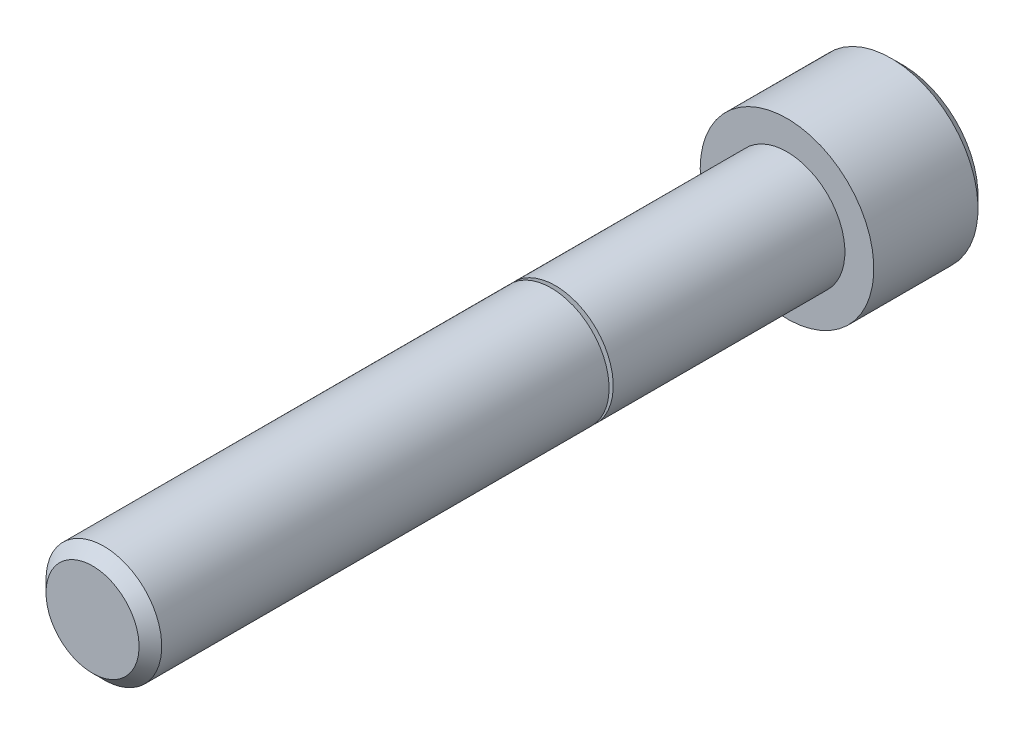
ISO-10303-21;
HEADER;
FILE_DESCRIPTION(('STEP AP214'),'2;1');
FILE_NAME('part.step','',(''),(''),'','','');
FILE_SCHEMA(('AUTOMOTIVE_DESIGN { 1 0 10303 214 1 1 1 1 }'));
ENDSEC;
DATA;
#1=APPLICATION_CONTEXT('core data for automotive mechanical design processes');
#2=APPLICATION_PROTOCOL_DEFINITION('international standard','automotive_design',2000,#1);
#3=PRODUCT_CONTEXT('',#1,'mechanical');
#4=PRODUCT('Part','Part','',(#3));
#5=PRODUCT_RELATED_PRODUCT_CATEGORY('part','',(#4));
#6=PRODUCT_DEFINITION_FORMATION('','',#4);
#7=PRODUCT_DEFINITION_CONTEXT('part definition',#1,'design');
#8=PRODUCT_DEFINITION('design','',#6,#7);
#9=PRODUCT_DEFINITION_SHAPE('','',#8);
#10=(LENGTH_UNIT() NAMED_UNIT(*) SI_UNIT(.MILLI.,.METRE.));
#11=(NAMED_UNIT(*) PLANE_ANGLE_UNIT() SI_UNIT($,.RADIAN.));
#12=(NAMED_UNIT(*) SI_UNIT($,.STERADIAN.) SOLID_ANGLE_UNIT());
#13=UNCERTAINTY_MEASURE_WITH_UNIT(LENGTH_MEASURE(1.E-05),#10,'distance_accuracy_value','');
#14=(GEOMETRIC_REPRESENTATION_CONTEXT(3) GLOBAL_UNCERTAINTY_ASSIGNED_CONTEXT((#13)) GLOBAL_UNIT_ASSIGNED_CONTEXT((#10,
#11,#12)) REPRESENTATION_CONTEXT('',''));
#15=CARTESIAN_POINT('',(0.,0.,0.));
#16=DIRECTION('',(0.,0.,1.));
#17=DIRECTION('',(1.,0.,0.));
#18=AXIS2_PLACEMENT_3D('',#15,#16,#17);
#19=CARTESIAN_POINT('',(0.,0.,-6.34999999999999));
#20=DIRECTION('',(0.,0.,1.));
#21=DIRECTION('',(1.,0.,0.));
#22=AXIS2_PLACEMENT_3D('',#19,#20,#21);
#23=PLANE('',#22);
#24=DIRECTION('',(-0.5,-0.866025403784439,0.));
#25=VECTOR('',#24,1.);
#26=CARTESIAN_POINT('',(2.74963065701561,0.,-6.34999999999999));
#27=LINE('',#26,#25);
#28=CARTESIAN_POINT('',(2.74963065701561,0.,-6.34999999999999));
#29=VERTEX_POINT('',#28);
#30=CARTESIAN_POINT('',(1.37481532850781,-2.38125000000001,-6.34999999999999));
#31=VERTEX_POINT('',#30);
#32=EDGE_CURVE('E145',#29,#31,#27,.T.);
#33=ORIENTED_EDGE('',*,*,#32,.F.);
#34=DIRECTION('',(0.499999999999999,-0.866025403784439,0.));
#35=VECTOR('',#34,1.);
#36=CARTESIAN_POINT('',(1.37481532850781,2.38125,-6.34999999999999));
#37=LINE('',#36,#35);
#38=CARTESIAN_POINT('',(1.37481532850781,2.38125,-6.34999999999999));
#39=VERTEX_POINT('',#38);
#40=EDGE_CURVE('E64',#39,#29,#37,.T.);
#41=ORIENTED_EDGE('',*,*,#40,.F.);
#42=DIRECTION('',(1.,0.,0.));
#43=VECTOR('',#42,1.);
#44=CARTESIAN_POINT('',(-1.37481532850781,2.38125,-6.34999999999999));
#45=LINE('',#44,#43);
#46=CARTESIAN_POINT('',(-1.37481532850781,2.38125,-6.34999999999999));
#47=VERTEX_POINT('',#46);
#48=EDGE_CURVE('E158',#47,#39,#45,.T.);
#49=ORIENTED_EDGE('',*,*,#48,.F.);
#50=DIRECTION('',(0.5,0.866025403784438,0.));
#51=VECTOR('',#50,1.);
#52=CARTESIAN_POINT('',(-2.74963065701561,0.,-6.34999999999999));
#53=LINE('',#52,#51);
#54=CARTESIAN_POINT('',(-2.74963065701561,0.,-6.34999999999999));
#55=VERTEX_POINT('',#54);
#56=EDGE_CURVE('E155',#55,#47,#53,.T.);
#57=ORIENTED_EDGE('',*,*,#56,.F.);
#58=DIRECTION('',(-0.5,0.866025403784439,0.));
#59=VECTOR('',#58,1.);
#60=CARTESIAN_POINT('',(-1.37481532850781,-2.38125000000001,-6.34999999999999));
#61=LINE('',#60,#59);
#62=CARTESIAN_POINT('',(-1.37481532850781,-2.38125000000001,-6.34999999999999));
#63=VERTEX_POINT('',#62);
#64=EDGE_CURVE('E112',#63,#55,#61,.T.);
#65=ORIENTED_EDGE('',*,*,#64,.F.);
#66=DIRECTION('',(-1.,0.,0.));
#67=VECTOR('',#66,1.);
#68=CARTESIAN_POINT('',(1.37481532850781,-2.38125000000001,-6.34999999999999));
#69=LINE('',#68,#67);
#70=EDGE_CURVE('E149',#31,#63,#69,.T.);
#71=ORIENTED_EDGE('',*,*,#70,.F.);
#72=EDGE_LOOP('',(#33,#41,#49,#57,#65,#71));
#73=FACE_BOUND('',#72,.T.);
#74=CARTESIAN_POINT('',(0.,0.,-6.34999999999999));
#75=DIRECTION('',(0.,0.,-1.));
#76=DIRECTION('',(-1.,0.,0.));
#77=AXIS2_PLACEMENT_3D('',#74,#75,#76);
#78=CIRCLE('',#77,4.1275);
#79=CARTESIAN_POINT('',(-4.1275,0.,-6.34999999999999));
#80=VERTEX_POINT('',#79);
#81=EDGE_CURVE('E164',#80,#80,#78,.T.);
#82=ORIENTED_EDGE('',*,*,#81,.T.);
#83=EDGE_LOOP('',(#82));
#84=FACE_BOUND('',#83,.T.);
#85=ADVANCED_FACE('F49',(#73,#84),#23,.F.);
#86=CARTESIAN_POINT('',(-2.55270000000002,0.,38.1));
#87=DIRECTION('',(0.,0.,-1.));
#88=DIRECTION('',(-1.,0.,0.));
#89=AXIS2_PLACEMENT_3D('',#86,#87,#88);
#90=PLANE('',#89);
#91=CARTESIAN_POINT('',(0.,0.,38.1));
#92=DIRECTION('',(0.,0.,-1.));
#93=DIRECTION('',(-1.,0.,0.));
#94=AXIS2_PLACEMENT_3D('',#91,#92,#93);
#95=CIRCLE('',#94,2.55270000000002);
#96=CARTESIAN_POINT('',(-2.55270000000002,0.,38.1));
#97=VERTEX_POINT('',#96);
#98=EDGE_CURVE('E11',#97,#97,#95,.T.);
#99=ORIENTED_EDGE('',*,*,#98,.F.);
#100=EDGE_LOOP('',(#99));
#101=FACE_BOUND('',#100,.T.);
#102=ADVANCED_FACE('F214',(#101),#90,.F.);
#103=CARTESIAN_POINT('',(0.,0.,38.1));
#104=DIRECTION('',(0.,0.,-1.));
#105=DIRECTION('',(-1.,0.,0.));
#106=AXIS2_PLACEMENT_3D('',#103,#104,#105);
#107=CONICAL_SURFACE('',#106,2.55270000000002,0.785398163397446);
#108=CARTESIAN_POINT('',(0.,0.,37.4777));
#109=DIRECTION('',(0.,0.,-1.));
#110=DIRECTION('',(-1.,0.,0.));
#111=AXIS2_PLACEMENT_3D('',#108,#109,#110);
#112=CIRCLE('',#111,3.17500000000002);
#113=CARTESIAN_POINT('',(-3.17500000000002,0.,37.4777));
#114=VERTEX_POINT('',#113);
#115=EDGE_CURVE('E57',#114,#114,#112,.T.);
#116=ORIENTED_EDGE('',*,*,#115,.F.);
#117=EDGE_LOOP('',(#116));
#118=FACE_BOUND('',#117,.T.);
#119=ORIENTED_EDGE('',*,*,#98,.T.);
#120=EDGE_LOOP('',(#119));
#121=FACE_BOUND('',#120,.T.);
#122=ADVANCED_FACE('F211',(#118,#121),#107,.T.);
#123=CARTESIAN_POINT('',(0.,0.,-10.585154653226));
#124=DIRECTION('',(0.,0.,-1.));
#125=DIRECTION('',(-1.,0.,0.));
#126=AXIS2_PLACEMENT_3D('',#123,#124,#125);
#127=CYLINDRICAL_SURFACE('',#126,3.17500000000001);
#128=CARTESIAN_POINT('',(0.,0.,12.9364986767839));
#129=DIRECTION('',(0.,0.,-1.));
#130=DIRECTION('',(-1.,0.,0.));
#131=AXIS2_PLACEMENT_3D('',#128,#129,#130);
#132=CIRCLE('',#131,3.17500000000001);
#133=CARTESIAN_POINT('',(-3.17500000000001,0.,12.9364986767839));
#134=VERTEX_POINT('',#133);
#135=EDGE_CURVE('E201',#134,#134,#132,.T.);
#136=ORIENTED_EDGE('',*,*,#135,.F.);
#137=EDGE_LOOP('',(#136));
#138=FACE_BOUND('',#137,.T.);
#139=ORIENTED_EDGE('',*,*,#115,.T.);
#140=EDGE_LOOP('',(#139));
#141=FACE_BOUND('',#140,.T.);
#142=ADVANCED_FACE('F209',(#138,#141),#127,.T.);
#143=CARTESIAN_POINT('',(0.,0.,12.9364986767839));
#144=DIRECTION('',(0.,0.,1.));
#145=DIRECTION('',(1.,0.,0.));
#146=AXIS2_PLACEMENT_3D('',#143,#144,#145);
#147=CONICAL_SURFACE('',#146,3.17500000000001,1.22173047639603);
#148=CARTESIAN_POINT('',(0.,0.,12.7487938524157));
#149=DIRECTION('',(0.,0.,-1.));
#150=DIRECTION('',(-1.,0.,0.));
#151=AXIS2_PLACEMENT_3D('',#148,#149,#150);
#152=CIRCLE('',#151,2.65928523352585);
#153=CARTESIAN_POINT('',(-2.65928523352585,0.,12.7487938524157));
#154=VERTEX_POINT('',#153);
#155=EDGE_CURVE('E197',#154,#154,#152,.T.);
#156=ORIENTED_EDGE('',*,*,#155,.F.);
#157=EDGE_LOOP('',(#156));
#158=FACE_BOUND('',#157,.T.);
#159=ORIENTED_EDGE('',*,*,#135,.T.);
#160=EDGE_LOOP('',(#159));
#161=FACE_BOUND('',#160,.T.);
#162=ADVANCED_FACE('F226',(#158,#161),#147,.T.);
#163=CARTESIAN_POINT('',(0.,0.,12.73));
#164=DIRECTION('',(0.,0.,-1.));
#165=DIRECTION('',(-1.,0.,0.));
#166=AXIS2_PLACEMENT_3D('',#163,#164,#165);
#167=TOROIDAL_SURFACE('',#166,2.66612563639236,0.0199999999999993);
#168=CARTESIAN_POINT('',(0.,0.,12.71));
#169=DIRECTION('',(0.,0.,-1.));
#170=DIRECTION('',(-1.,0.,0.));
#171=AXIS2_PLACEMENT_3D('',#168,#169,#170);
#172=CIRCLE('',#171,2.66612563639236);
#173=CARTESIAN_POINT('',(-2.66612563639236,0.,12.71));
#174=VERTEX_POINT('',#173);
#175=EDGE_CURVE('E193',#174,#174,#172,.T.);
#176=ORIENTED_EDGE('',*,*,#175,.F.);
#177=EDGE_LOOP('',(#176));
#178=FACE_BOUND('',#177,.T.);
#179=ORIENTED_EDGE('',*,*,#155,.T.);
#180=EDGE_LOOP('',(#179));
#181=FACE_BOUND('',#180,.T.);
#182=ADVANCED_FACE('F230',(#178,#181),#167,.F.);
#183=CARTESIAN_POINT('',(-3.17499999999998,0.,12.71));
#184=DIRECTION('',(0.,0.,-1.));
#185=DIRECTION('',(-1.,0.,0.));
#186=AXIS2_PLACEMENT_3D('',#183,#184,#185);
#187=PLANE('',#186);
#188=CARTESIAN_POINT('',(0.,0.,12.71));
#189=DIRECTION('',(0.,0.,-1.));
#190=DIRECTION('',(-1.,0.,0.));
#191=AXIS2_PLACEMENT_3D('',#188,#189,#190);
#192=CIRCLE('',#191,3.17500000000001);
#193=CARTESIAN_POINT('',(-3.17500000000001,0.,12.71));
#194=VERTEX_POINT('',#193);
#195=EDGE_CURVE('E189',#194,#194,#192,.T.);
#196=ORIENTED_EDGE('',*,*,#195,.F.);
#197=EDGE_LOOP('',(#196));
#198=FACE_BOUND('',#197,.T.);
#199=ORIENTED_EDGE('',*,*,#175,.T.);
#200=EDGE_LOOP('',(#199));
#201=FACE_BOUND('',#200,.T.);
#202=ADVANCED_FACE('F234',(#198,#201),#187,.F.);
#203=CARTESIAN_POINT('',(0.,0.,-10.585154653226));
#204=DIRECTION('',(0.,0.,-1.));
#205=DIRECTION('',(-1.,0.,0.));
#206=AXIS2_PLACEMENT_3D('',#203,#204,#205);
#207=CYLINDRICAL_SURFACE('',#206,3.17500000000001);
#208=CARTESIAN_POINT('',(0.,0.,0.));
#209=DIRECTION('',(0.,0.,-1.));
#210=DIRECTION('',(-1.,0.,0.));
#211=AXIS2_PLACEMENT_3D('',#208,#209,#210);
#212=CIRCLE('',#211,3.175);
#213=CARTESIAN_POINT('',(-3.175,0.,0.));
#214=VERTEX_POINT('',#213);
#215=EDGE_CURVE('E185',#214,#214,#212,.T.);
#216=ORIENTED_EDGE('',*,*,#215,.F.);
#217=EDGE_LOOP('',(#216));
#218=FACE_BOUND('',#217,.T.);
#219=ORIENTED_EDGE('',*,*,#195,.T.);
#220=EDGE_LOOP('',(#219));
#221=FACE_BOUND('',#220,.T.);
#222=ADVANCED_FACE('F238',(#218,#221),#207,.T.);
#223=CARTESIAN_POINT('',(-4.7625,0.,0.));
#224=DIRECTION('',(0.,0.,-1.));
#225=DIRECTION('',(-1.,0.,0.));
#226=AXIS2_PLACEMENT_3D('',#223,#224,#225);
#227=PLANE('',#226);
#228=CARTESIAN_POINT('',(0.,0.,0.));
#229=DIRECTION('',(0.,0.,-1.));
#230=DIRECTION('',(-1.,0.,0.));
#231=AXIS2_PLACEMENT_3D('',#228,#229,#230);
#232=CIRCLE('',#231,4.7625);
#233=CARTESIAN_POINT('',(-4.7625,0.,0.));
#234=VERTEX_POINT('',#233);
#235=EDGE_CURVE('E181',#234,#234,#232,.T.);
#236=ORIENTED_EDGE('',*,*,#235,.F.);
#237=EDGE_LOOP('',(#236));
#238=FACE_BOUND('',#237,.T.);
#239=ORIENTED_EDGE('',*,*,#215,.T.);
#240=EDGE_LOOP('',(#239));
#241=FACE_BOUND('',#240,.T.);
#242=ADVANCED_FACE('F242',(#238,#241),#227,.F.);
#243=CARTESIAN_POINT('',(0.,0.,-10.585154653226));
#244=DIRECTION('',(0.,0.,-1.));
#245=DIRECTION('',(-1.,0.,0.));
#246=AXIS2_PLACEMENT_3D('',#243,#244,#245);
#247=CYLINDRICAL_SURFACE('',#246,4.7625);
#248=CARTESIAN_POINT('',(0.,0.,-5.715));
#249=DIRECTION('',(0.,0.,-1.));
#250=DIRECTION('',(-1.,0.,0.));
#251=AXIS2_PLACEMENT_3D('',#248,#249,#250);
#252=CIRCLE('',#251,4.7625);
#253=CARTESIAN_POINT('',(-4.7625,0.,-5.715));
#254=VERTEX_POINT('',#253);
#255=EDGE_CURVE('E177',#254,#254,#252,.T.);
#256=ORIENTED_EDGE('',*,*,#255,.F.);
#257=EDGE_LOOP('',(#256));
#258=FACE_BOUND('',#257,.T.);
#259=ORIENTED_EDGE('',*,*,#235,.T.);
#260=EDGE_LOOP('',(#259));
#261=FACE_BOUND('',#260,.T.);
#262=ADVANCED_FACE('F246',(#258,#261),#247,.T.);
#263=CARTESIAN_POINT('',(0.,0.,-5.715));
#264=DIRECTION('',(0.,0.,1.));
#265=DIRECTION('',(1.,0.,0.));
#266=AXIS2_PLACEMENT_3D('',#263,#264,#265);
#267=CONICAL_SURFACE('',#266,4.7625,0.785398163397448);
#268=ORIENTED_EDGE('',*,*,#81,.F.);
#269=EDGE_LOOP('',(#268));
#270=FACE_BOUND('',#269,.T.);
#271=ORIENTED_EDGE('',*,*,#255,.T.);
#272=EDGE_LOOP('',(#271));
#273=FACE_BOUND('',#272,.T.);
#274=ADVANCED_FACE('F250',(#270,#273),#267,.T.);
#275=CARTESIAN_POINT('',(1.37481532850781,2.38125,-3.175));
#276=DIRECTION('',(0.866025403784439,0.499999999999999,0.));
#277=DIRECTION('',(-0.5,0.866025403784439,0.));
#278=AXIS2_PLACEMENT_3D('',#275,#276,#277);
#279=PLANE('',#278);
#280=ORIENTED_EDGE('',*,*,#40,.T.);
#281=DIRECTION('',(0.,0.,-1.));
#282=VECTOR('',#281,1.);
#283=CARTESIAN_POINT('',(2.74963065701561,0.,-3.175));
#284=LINE('',#283,#282);
#285=CARTESIAN_POINT('',(2.74963065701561,0.,-3.175));
#286=VERTEX_POINT('',#285);
#287=EDGE_CURVE('E94',#286,#29,#284,.T.);
#288=ORIENTED_EDGE('',*,*,#287,.F.);
#289=DIRECTION('',(0.499999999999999,-0.866025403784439,0.));
#290=VECTOR('',#289,1.);
#291=CARTESIAN_POINT('',(1.37481532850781,2.38125,-3.175));
#292=LINE('',#291,#290);
#293=CARTESIAN_POINT('',(1.37481532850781,2.38125,-3.175));
#294=VERTEX_POINT('',#293);
#295=EDGE_CURVE('E161',#294,#286,#292,.T.);
#296=ORIENTED_EDGE('',*,*,#295,.F.);
#297=DIRECTION('',(0.,0.,-1.));
#298=VECTOR('',#297,1.);
#299=CARTESIAN_POINT('',(1.37481532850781,2.38125,-3.175));
#300=LINE('',#299,#298);
#301=EDGE_CURVE('E72',#294,#39,#300,.T.);
#302=ORIENTED_EDGE('',*,*,#301,.T.);
#303=EDGE_LOOP('',(#280,#288,#296,#302));
#304=FACE_BOUND('',#303,.T.);
#305=ADVANCED_FACE('F254',(#304),#279,.F.);
#306=CARTESIAN_POINT('',(-1.37481532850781,2.38125,-3.175));
#307=DIRECTION('',(0.,1.,0.));
#308=DIRECTION('',(-1.,0.,0.));
#309=AXIS2_PLACEMENT_3D('',#306,#307,#308);
#310=PLANE('',#309);
#311=ORIENTED_EDGE('',*,*,#48,.T.);
#312=ORIENTED_EDGE('',*,*,#301,.F.);
#313=DIRECTION('',(1.,0.,0.));
#314=VECTOR('',#313,1.);
#315=CARTESIAN_POINT('',(-1.37481532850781,2.38125,-3.175));
#316=LINE('',#315,#314);
#317=CARTESIAN_POINT('',(-1.37481532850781,2.38125,-3.175));
#318=VERTEX_POINT('',#317);
#319=EDGE_CURVE('E126',#318,#294,#316,.T.);
#320=ORIENTED_EDGE('',*,*,#319,.F.);
#321=DIRECTION('',(0.,0.,-1.));
#322=VECTOR('',#321,1.);
#323=CARTESIAN_POINT('',(-1.37481532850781,2.38125,-3.175));
#324=LINE('',#323,#322);
#325=EDGE_CURVE('E117',#318,#47,#324,.T.);
#326=ORIENTED_EDGE('',*,*,#325,.T.);
#327=EDGE_LOOP('',(#311,#312,#320,#326));
#328=FACE_BOUND('',#327,.T.);
#329=ADVANCED_FACE('F258',(#328),#310,.F.);
#330=CARTESIAN_POINT('',(-2.74963065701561,0.,-3.175));
#331=DIRECTION('',(-0.866025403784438,0.5,0.));
#332=DIRECTION('',(-0.5,-0.866025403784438,0.));
#333=AXIS2_PLACEMENT_3D('',#330,#331,#332);
#334=PLANE('',#333);
#335=ORIENTED_EDGE('',*,*,#56,.T.);
#336=ORIENTED_EDGE('',*,*,#325,.F.);
#337=DIRECTION('',(0.5,0.866025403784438,0.));
#338=VECTOR('',#337,1.);
#339=CARTESIAN_POINT('',(-2.74963065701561,0.,-3.175));
#340=LINE('',#339,#338);
#341=CARTESIAN_POINT('',(-2.74963065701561,0.,-3.175));
#342=VERTEX_POINT('',#341);
#343=EDGE_CURVE('E121',#342,#318,#340,.T.);
#344=ORIENTED_EDGE('',*,*,#343,.F.);
#345=DIRECTION('',(0.,0.,-1.));
#346=VECTOR('',#345,1.);
#347=CARTESIAN_POINT('',(-2.74963065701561,0.,-3.175));
#348=LINE('',#347,#346);
#349=EDGE_CURVE('E105',#342,#55,#348,.T.);
#350=ORIENTED_EDGE('',*,*,#349,.T.);
#351=EDGE_LOOP('',(#335,#336,#344,#350));
#352=FACE_BOUND('',#351,.T.);
#353=ADVANCED_FACE('F122',(#352),#334,.F.);
#354=CARTESIAN_POINT('',(-1.37481532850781,-2.38125000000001,-3.175));
#355=DIRECTION('',(-0.866025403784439,-0.5,0.));
#356=DIRECTION('',(0.5,-0.866025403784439,0.));
#357=AXIS2_PLACEMENT_3D('',#354,#355,#356);
#358=PLANE('',#357);
#359=ORIENTED_EDGE('',*,*,#64,.T.);
#360=ORIENTED_EDGE('',*,*,#349,.F.);
#361=DIRECTION('',(-0.5,0.866025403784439,0.));
#362=VECTOR('',#361,1.);
#363=CARTESIAN_POINT('',(-1.37481532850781,-2.38125000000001,-3.175));
#364=LINE('',#363,#362);
#365=CARTESIAN_POINT('',(-1.37481532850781,-2.38125000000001,-3.175));
#366=VERTEX_POINT('',#365);
#367=EDGE_CURVE('E109',#366,#342,#364,.T.);
#368=ORIENTED_EDGE('',*,*,#367,.F.);
#369=DIRECTION('',(0.,0.,-1.));
#370=VECTOR('',#369,1.);
#371=CARTESIAN_POINT('',(-1.37481532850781,-2.38125000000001,-3.175));
#372=LINE('',#371,#370);
#373=EDGE_CURVE('E118',#366,#63,#372,.T.);
#374=ORIENTED_EDGE('',*,*,#373,.T.);
#375=EDGE_LOOP('',(#359,#360,#368,#374));
#376=FACE_BOUND('',#375,.T.);
#377=ADVANCED_FACE('F107',(#376),#358,.F.);
#378=CARTESIAN_POINT('',(1.37481532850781,-2.38125000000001,-3.175));
#379=DIRECTION('',(0.,-1.,0.));
#380=DIRECTION('',(0.,0.,-1.));
#381=AXIS2_PLACEMENT_3D('',#378,#379,#380);
#382=PLANE('',#381);
#383=ORIENTED_EDGE('',*,*,#70,.T.);
#384=ORIENTED_EDGE('',*,*,#373,.F.);
#385=DIRECTION('',(-1.,0.,0.));
#386=VECTOR('',#385,1.);
#387=CARTESIAN_POINT('',(1.37481532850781,-2.38125000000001,-3.175));
#388=LINE('',#387,#386);
#389=CARTESIAN_POINT('',(1.37481532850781,-2.38125000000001,-3.175));
#390=VERTEX_POINT('',#389);
#391=EDGE_CURVE('E132',#390,#366,#388,.T.);
#392=ORIENTED_EDGE('',*,*,#391,.F.);
#393=DIRECTION('',(0.,0.,-1.));
#394=VECTOR('',#393,1.);
#395=CARTESIAN_POINT('',(1.37481532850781,-2.38125000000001,-3.175));
#396=LINE('',#395,#394);
#397=EDGE_CURVE('E169',#390,#31,#396,.T.);
#398=ORIENTED_EDGE('',*,*,#397,.T.);
#399=EDGE_LOOP('',(#383,#384,#392,#398));
#400=FACE_BOUND('',#399,.T.);
#401=ADVANCED_FACE('F262',(#400),#382,.F.);
#402=CARTESIAN_POINT('',(2.74963065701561,0.,-3.175));
#403=DIRECTION('',(0.866025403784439,-0.5,0.));
#404=DIRECTION('',(0.5,0.866025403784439,0.));
#405=AXIS2_PLACEMENT_3D('',#402,#403,#404);
#406=PLANE('',#405);
#407=ORIENTED_EDGE('',*,*,#32,.T.);
#408=ORIENTED_EDGE('',*,*,#397,.F.);
#409=DIRECTION('',(-0.5,-0.866025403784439,0.));
#410=VECTOR('',#409,1.);
#411=CARTESIAN_POINT('',(2.74963065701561,0.,-3.175));
#412=LINE('',#411,#410);
#413=EDGE_CURVE('E137',#286,#390,#412,.T.);
#414=ORIENTED_EDGE('',*,*,#413,.F.);
#415=ORIENTED_EDGE('',*,*,#287,.T.);
#416=EDGE_LOOP('',(#407,#408,#414,#415));
#417=FACE_BOUND('',#416,.T.);
#418=ADVANCED_FACE('F259',(#417),#406,.F.);
#419=CARTESIAN_POINT('',(1.37481532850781,2.38125,-3.175));
#420=DIRECTION('',(0.,0.,1.));
#421=DIRECTION('',(1.,0.,0.));
#422=AXIS2_PLACEMENT_3D('',#419,#420,#421);
#423=PLANE('',#422);
#424=ORIENTED_EDGE('',*,*,#295,.T.);
#425=ORIENTED_EDGE('',*,*,#413,.T.);
#426=ORIENTED_EDGE('',*,*,#391,.T.);
#427=ORIENTED_EDGE('',*,*,#367,.T.);
#428=ORIENTED_EDGE('',*,*,#343,.T.);
#429=ORIENTED_EDGE('',*,*,#319,.T.);
#430=EDGE_LOOP('',(#424,#425,#426,#427,#428,#429));
#431=FACE_BOUND('',#430,.T.);
#432=ADVANCED_FACE('F129',(#431),#423,.F.);
#433=CLOSED_SHELL('',(#85,#102,#122,#142,#162,#182,#202,#222,#242,#262,#274,#305,#329,#353,#377,
#401,#418,#432));
#434=MANIFOLD_SOLID_BREP('B2',#433);
#435=ADVANCED_BREP_SHAPE_REPRESENTATION('',(#18,#434),#14);
#436=SHAPE_DEFINITION_REPRESENTATION(#9,#435);
ENDSEC;
END-ISO-10303-21;
